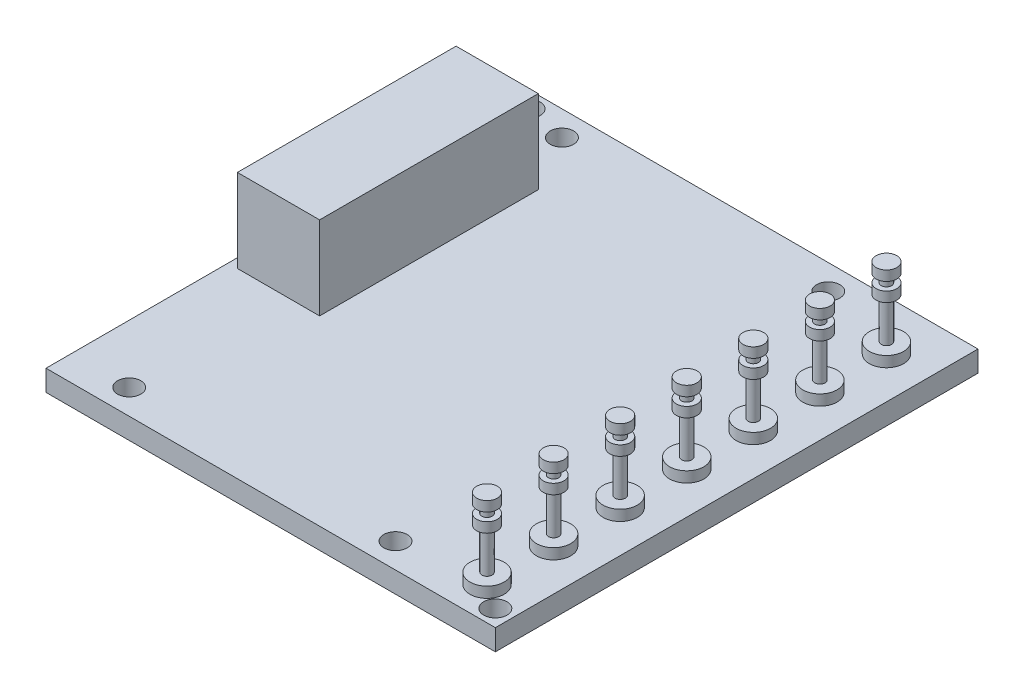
from build123d import *

# Parameters (mm, degrees)
SKETCH1_W                  = 34.29
SKETCH1_H                  = 36.83
BOSS_EXTRUDE1_DEPTH        = 1.6002
SKETCH2_W                  = 6.2738
SKETCH2_H                  = 16.6878
BOSS_EXTRUDE2_DEPTH        = 6.35
SKETCH3_R                  = 0.32766
BOSS_EXTRUDE3_DEPTH        = 1.4732
F_50_0_07_DIAMETER_HOLE1_D = 1.778
LPATTERN1_COUNT            = 7
LPATTERN1_PITCH            = 5.08
F_50_0_07_DIAMETER_HOLE2_D = 1.778


with BuildPart() as part:
    # Sketch1 → Boss-Extrude1 (new body)
    with BuildSketch(Plane(origin=(0, 0, 0), x_dir=(1, 0, 0), z_dir=(0, 1, 0))):
        Rectangle(SKETCH1_W, SKETCH1_H)
    extrude(amount=BOSS_EXTRUDE1_DEPTH)

    # Sketch2 → Boss-Extrude2 (add)
    with BuildSketch(Plane(origin=(0, 1.6002, 0), x_dir=(1, 0, 0), z_dir=(0, 1, 0))):
        with Locations((-13.2969, 3.8227)):
            Rectangle(SKETCH2_W, SKETCH2_H)
    extrude(amount=BOSS_EXTRUDE2_DEPTH)

    # Sketch3 → Boss-Extrude3 (add)
    with BuildSketch(Plane.XZ):
        with Locations(Location((-10.627365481, -5.990493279, 0), (0, 0, 270))):
            Circle(SKETCH3_R)
    extrude(amount=BOSS_EXTRUDE3_DEPTH)

    # 50 _0.07_ Diameter Hole1 (through all)
    with Locations(Plane(origin=(0, 1.6002, 0), x_dir=(1, 0, 0), z_dir=(0, 1, 0))):
        with Locations((-15.875, 17.145), (15.875, -17.145)):
            Hole(F_50_0_07_DIAMETER_HOLE1_D / 2)

    # Sketch6 → Revolve1 (revolve)
    with BuildSketch(Plane(origin=(13.97, 0, 0), x_dir=(0, 0, -1), z_dir=(1, 0, 0)), mode=Mode.PRIVATE) as revolve1_sk:
        Polygon((-15.875, 1.6002), (-17.1831, 1.6002), (-17.1831, 2.413), (-16.2687, 2.413), (-16.2687, 5.5372), (-16.6624, 5.5372), (-16.6624, 6.2992), (-16.2687, 6.2992), (-16.2687, 6.9342), (-16.6624, 6.9342), (-16.6624, 7.6962), (-15.875, 7.6962), align=None)
    revolve1 = revolve(revolve1_sk.sketch.rotate(Axis((13.97, 1.6002, 15.875), (0, 1, 0)), 180), axis=Axis((13.97, 1.6002, 15.875), (0, 1, 0)))

    # LPattern1: Revolve1 ×7
    with Locations(*[(0, 0, -i * LPATTERN1_PITCH) for i in range(1, LPATTERN1_COUNT)]):
        add(revolve1)

    # 50 _0.07_ Diameter Hole2 (through all)
    with Locations(Plane(origin=(0, 1.6002, 0), x_dir=(1, 0, 0), z_dir=(0, 1, 0))):
        with Locations((-12.7, 16.51), (7.62, 16.51), (-12.7, -16.51), (7.62, -16.51)):
            Hole(F_50_0_07_DIAMETER_HOLE2_D / 2)


solid = part.part
